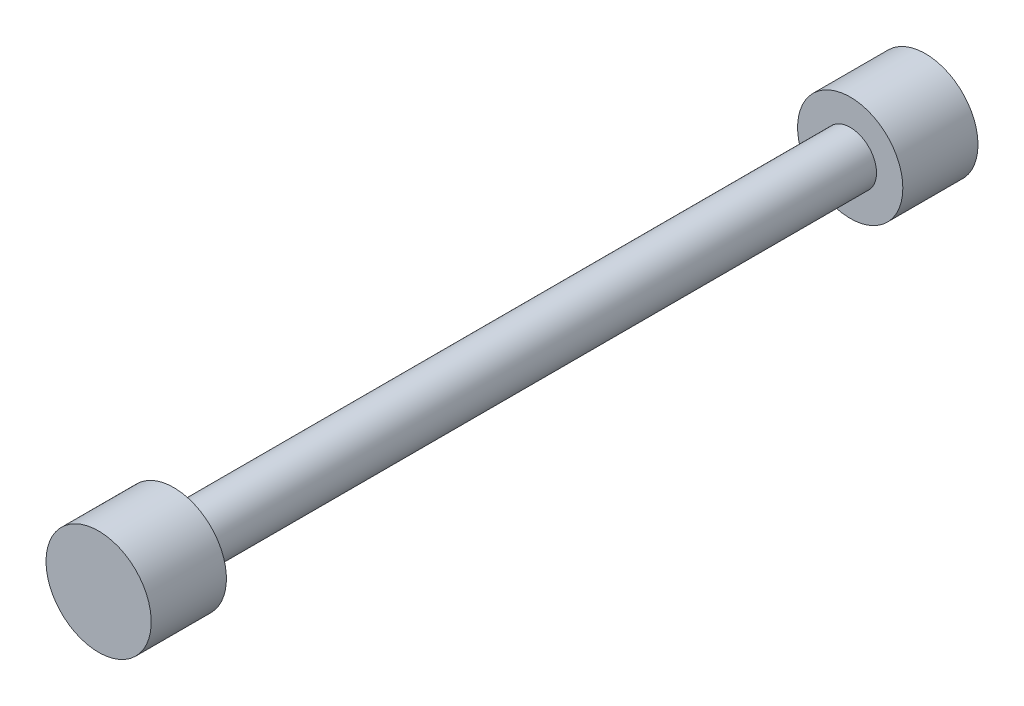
from build123d import *

# Parameters (mm, degrees)
ESQUISSE1_R          = 3.5
BASE_EXTRUSION_DEPTH = 100
ESQUISSE2_W          = 7
ESQUISSE2_H          = 10
ESQUISSE3_W          = 7
ESQUISSE3_H          = 10


with BuildPart() as part:
    # Esquisse1 → Base-Extrusion (new body)
    with BuildSketch(Plane.XY):
        with Locations(Location((0, 0, 0), (0, 0, 180))):
            Circle(ESQUISSE1_R)
    extrude(amount=BASE_EXTRUSION_DEPTH)

    # Esquisse2 → Boss.-R_vol.1 (revolve)
    with BuildSketch(Plane(origin=(0, 0, 0), x_dir=(1, 0, 0), z_dir=(0, 1, 0))):
        with Locations((-3.5, 0)):
            Rectangle(ESQUISSE2_W, ESQUISSE2_H)
    revolve(axis=Axis((0, 0, 10), (0, 0, -1)))

    # Esquisse3 → Boss.-R_vol.2 (revolve)
    with BuildSketch(Plane(origin=(0, 0, 0), x_dir=(1, 0, 0), z_dir=(0, 1, 0)), mode=Mode.PRIVATE) as boss_r_vol_2_sk:
        with Locations((3.5, -100)):
            Rectangle(ESQUISSE3_W, ESQUISSE3_H)
    revolve(boss_r_vol_2_sk.sketch.rotate(Axis((0, 0, 90), (0, 0, 1)), 180), axis=Axis((0, 0, 90), (0, 0, 1)))


solid = part.part
